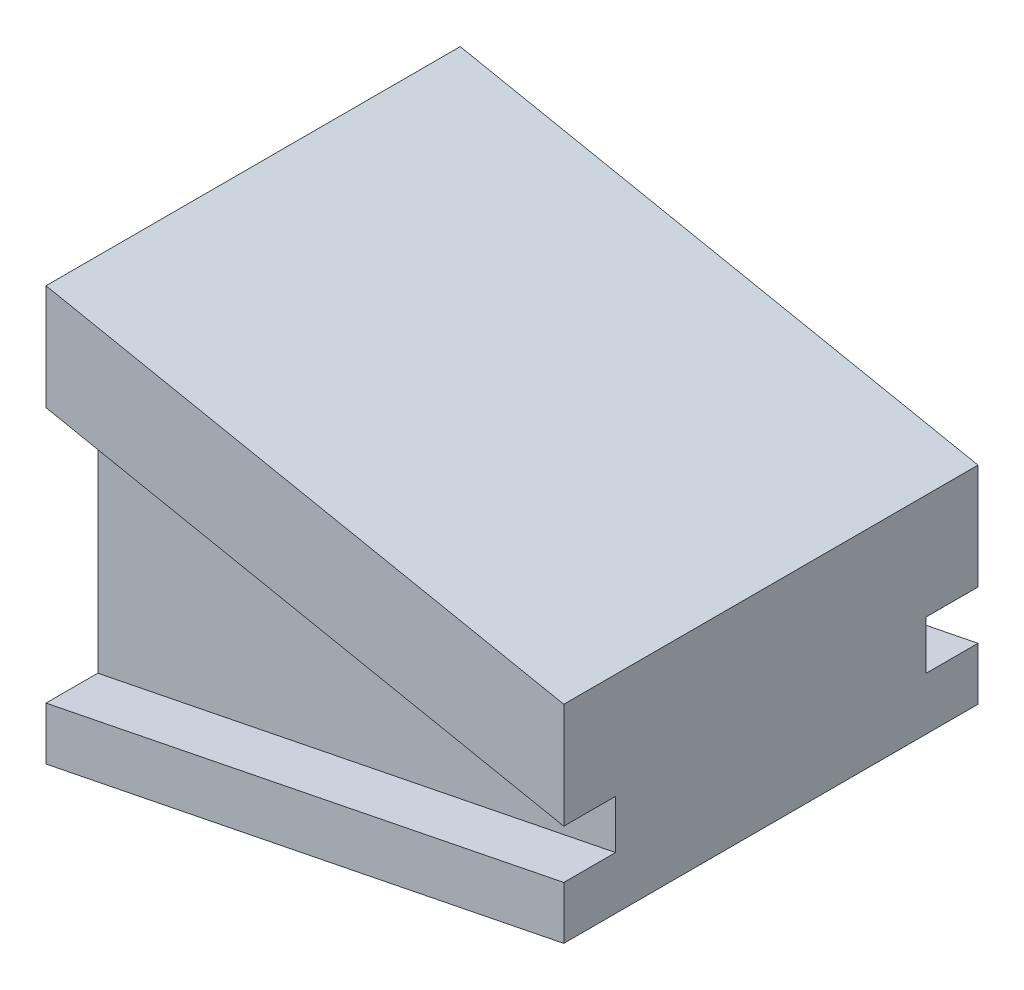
ISO-10303-21;
HEADER;
FILE_DESCRIPTION(('STEP AP214'),'2;1');
FILE_NAME('part.step','',(''),(''),'','','');
FILE_SCHEMA(('AUTOMOTIVE_DESIGN { 1 0 10303 214 1 1 1 1 }'));
ENDSEC;
DATA;
#1=APPLICATION_CONTEXT('core data for automotive mechanical design processes');
#2=APPLICATION_PROTOCOL_DEFINITION('international standard','automotive_design',2000,#1);
#3=PRODUCT_CONTEXT('',#1,'mechanical');
#4=PRODUCT('Part','Part','',(#3));
#5=PRODUCT_RELATED_PRODUCT_CATEGORY('part','',(#4));
#6=PRODUCT_DEFINITION_FORMATION('','',#4);
#7=PRODUCT_DEFINITION_CONTEXT('part definition',#1,'design');
#8=PRODUCT_DEFINITION('design','',#6,#7);
#9=PRODUCT_DEFINITION_SHAPE('','',#8);
#10=(LENGTH_UNIT() NAMED_UNIT(*) SI_UNIT(.MILLI.,.METRE.));
#11=(NAMED_UNIT(*) PLANE_ANGLE_UNIT() SI_UNIT($,.RADIAN.));
#12=(NAMED_UNIT(*) SI_UNIT($,.STERADIAN.) SOLID_ANGLE_UNIT());
#13=UNCERTAINTY_MEASURE_WITH_UNIT(LENGTH_MEASURE(1.E-05),#10,'distance_accuracy_value','');
#14=(GEOMETRIC_REPRESENTATION_CONTEXT(3) GLOBAL_UNCERTAINTY_ASSIGNED_CONTEXT((#13)) GLOBAL_UNIT_ASSIGNED_CONTEXT((#10,
#11,#12)) REPRESENTATION_CONTEXT('',''));
#15=CARTESIAN_POINT('',(0.,0.,0.));
#16=DIRECTION('',(0.,0.,1.));
#17=DIRECTION('',(1.,0.,0.));
#18=AXIS2_PLACEMENT_3D('',#15,#16,#17);
#19=CARTESIAN_POINT('',(0.,0.,0.));
#20=DIRECTION('',(0.,0.,-1.));
#21=DIRECTION('',(-1.,0.,0.));
#22=AXIS2_PLACEMENT_3D('',#19,#20,#21);
#23=PLANE('',#22);
#24=DIRECTION('',(-0.98058067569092,-0.196116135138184,0.));
#25=VECTOR('',#24,1.);
#26=CARTESIAN_POINT('',(-0.980580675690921,4.9029033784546,0.));
#27=LINE('',#26,#25);
#28=CARTESIAN_POINT('',(0.,5.09901951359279,0.));
#29=VERTEX_POINT('',#28);
#30=CARTESIAN_POINT('',(-50.,-4.90098048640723,0.));
#31=VERTEX_POINT('',#30);
#32=EDGE_CURVE('E11',#29,#31,#27,.T.);
#33=ORIENTED_EDGE('',*,*,#32,.F.);
#34=DIRECTION('',(0.,1.,0.));
#35=VECTOR('',#34,1.);
#36=CARTESIAN_POINT('',(0.,0.,0.));
#37=LINE('',#36,#35);
#38=CARTESIAN_POINT('',(0.,0.,0.));
#39=VERTEX_POINT('',#38);
#40=EDGE_CURVE('E166',#39,#29,#37,.T.);
#41=ORIENTED_EDGE('',*,*,#40,.F.);
#42=DIRECTION('',(0.98058067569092,0.196116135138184,0.));
#43=VECTOR('',#42,1.);
#44=CARTESIAN_POINT('',(0.,0.,0.));
#45=LINE('',#44,#43);
#46=CARTESIAN_POINT('',(-50.,-10.,0.));
#47=VERTEX_POINT('',#46);
#48=EDGE_CURVE('E202',#47,#39,#45,.T.);
#49=ORIENTED_EDGE('',*,*,#48,.F.);
#50=DIRECTION('',(0.,-1.,0.));
#51=VECTOR('',#50,1.);
#52=CARTESIAN_POINT('',(-50.,-10.,0.));
#53=LINE('',#52,#51);
#54=EDGE_CURVE('E231',#31,#47,#53,.T.);
#55=ORIENTED_EDGE('',*,*,#54,.F.);
#56=EDGE_LOOP('',(#33,#41,#49,#55));
#57=FACE_BOUND('',#56,.T.);
#58=ADVANCED_FACE('F51',(#57),#23,.T.);
#59=CARTESIAN_POINT('',(0.,0.,40.));
#60=DIRECTION('',(-1.,0.,0.));
#61=DIRECTION('',(0.,-1.,0.));
#62=AXIS2_PLACEMENT_3D('',#59,#60,#61);
#63=PLANE('',#62);
#64=ORIENTED_EDGE('',*,*,#40,.T.);
#65=DIRECTION('',(0.,0.,1.));
#66=VECTOR('',#65,1.);
#67=CARTESIAN_POINT('',(0.,5.09901951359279,-1.2E-05));
#68=LINE('',#67,#66);
#69=CARTESIAN_POINT('',(0.,5.09901951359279,5.));
#70=VERTEX_POINT('',#69);
#71=EDGE_CURVE('E144',#29,#70,#68,.T.);
#72=ORIENTED_EDGE('',*,*,#71,.T.);
#73=DIRECTION('',(0.,1.,0.));
#74=VECTOR('',#73,1.);
#75=CARTESIAN_POINT('',(0.,5.09901951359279,5.));
#76=LINE('',#75,#74);
#77=CARTESIAN_POINT('',(0.,9.80196097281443,5.));
#78=VERTEX_POINT('',#77);
#79=EDGE_CURVE('E153',#70,#78,#76,.T.);
#80=ORIENTED_EDGE('',*,*,#79,.T.);
#81=DIRECTION('',(0.,0.,1.));
#82=VECTOR('',#81,1.);
#83=CARTESIAN_POINT('',(0.,9.80196097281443,-1.2E-05));
#84=LINE('',#83,#82);
#85=CARTESIAN_POINT('',(0.,9.80196097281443,0.));
#86=VERTEX_POINT('',#85);
#87=EDGE_CURVE('E257',#86,#78,#84,.T.);
#88=ORIENTED_EDGE('',*,*,#87,.F.);
#89=CARTESIAN_POINT('',(0.,20.,0.));
#90=VERTEX_POINT('',#89);
#91=EDGE_CURVE('E225',#86,#90,#37,.T.);
#92=ORIENTED_EDGE('',*,*,#91,.T.);
#93=DIRECTION('',(0.,0.,-1.));
#94=VECTOR('',#93,1.);
#95=CARTESIAN_POINT('',(0.,20.,40.));
#96=LINE('',#95,#94);
#97=CARTESIAN_POINT('',(0.,20.,40.));
#98=VERTEX_POINT('',#97);
#99=EDGE_CURVE('E242',#98,#90,#96,.T.);
#100=ORIENTED_EDGE('',*,*,#99,.F.);
#101=DIRECTION('',(0.,1.,0.));
#102=VECTOR('',#101,1.);
#103=CARTESIAN_POINT('',(0.,0.,40.));
#104=LINE('',#103,#102);
#105=CARTESIAN_POINT('',(0.,9.80196097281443,40.));
#106=VERTEX_POINT('',#105);
#107=EDGE_CURVE('E207',#106,#98,#104,.T.);
#108=ORIENTED_EDGE('',*,*,#107,.F.);
#109=DIRECTION('',(0.,0.,-1.));
#110=VECTOR('',#109,1.);
#111=CARTESIAN_POINT('',(0.,9.80196097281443,40.000012));
#112=LINE('',#111,#110);
#113=CARTESIAN_POINT('',(0.,9.80196097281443,35.));
#114=VERTEX_POINT('',#113);
#115=EDGE_CURVE('E198',#106,#114,#112,.T.);
#116=ORIENTED_EDGE('',*,*,#115,.T.);
#117=DIRECTION('',(0.,1.,0.));
#118=VECTOR('',#117,1.);
#119=CARTESIAN_POINT('',(0.,5.09901951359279,35.));
#120=LINE('',#119,#118);
#121=CARTESIAN_POINT('',(0.,5.09901951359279,35.));
#122=VERTEX_POINT('',#121);
#123=EDGE_CURVE('E168',#122,#114,#120,.T.);
#124=ORIENTED_EDGE('',*,*,#123,.F.);
#125=DIRECTION('',(0.,0.,-1.));
#126=VECTOR('',#125,1.);
#127=CARTESIAN_POINT('',(0.,5.09901951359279,40.000012));
#128=LINE('',#127,#126);
#129=CARTESIAN_POINT('',(0.,5.09901951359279,40.));
#130=VERTEX_POINT('',#129);
#131=EDGE_CURVE('E190',#130,#122,#128,.T.);
#132=ORIENTED_EDGE('',*,*,#131,.F.);
#133=CARTESIAN_POINT('',(0.,0.,40.));
#134=VERTEX_POINT('',#133);
#135=EDGE_CURVE('E209',#134,#130,#104,.T.);
#136=ORIENTED_EDGE('',*,*,#135,.F.);
#137=DIRECTION('',(0.,0.,-1.));
#138=VECTOR('',#137,1.);
#139=CARTESIAN_POINT('',(0.,0.,40.));
#140=LINE('',#139,#138);
#141=EDGE_CURVE('E245',#134,#39,#140,.T.);
#142=ORIENTED_EDGE('',*,*,#141,.T.);
#143=EDGE_LOOP('',(#64,#72,#80,#88,#92,#100,#108,#116,#124,#132,#136,#142));
#144=FACE_BOUND('',#143,.T.);
#145=ADVANCED_FACE('F164',(#144),#63,.F.);
#146=CARTESIAN_POINT('',(-50.,-10.,40.));
#147=DIRECTION('',(1.,0.,0.));
#148=DIRECTION('',(0.,1.,0.));
#149=AXIS2_PLACEMENT_3D('',#146,#147,#148);
#150=PLANE('',#149);
#151=DIRECTION('',(0.,-1.,0.));
#152=VECTOR('',#151,1.);
#153=CARTESIAN_POINT('',(-50.,19.8019609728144,5.));
#154=LINE('',#153,#152);
#155=CARTESIAN_POINT('',(-50.,19.8019609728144,5.));
#156=VERTEX_POINT('',#155);
#157=CARTESIAN_POINT('',(-50.,-4.90098048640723,5.));
#158=VERTEX_POINT('',#157);
#159=EDGE_CURVE('E152',#156,#158,#154,.T.);
#160=ORIENTED_EDGE('',*,*,#159,.T.);
#161=DIRECTION('',(0.,0.,1.));
#162=VECTOR('',#161,1.);
#163=CARTESIAN_POINT('',(-50.,-4.90098048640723,-1.2E-05));
#164=LINE('',#163,#162);
#165=EDGE_CURVE('E147',#31,#158,#164,.T.);
#166=ORIENTED_EDGE('',*,*,#165,.F.);
#167=ORIENTED_EDGE('',*,*,#54,.T.);
#168=DIRECTION('',(0.,0.,-1.));
#169=VECTOR('',#168,1.);
#170=CARTESIAN_POINT('',(-50.,-10.,40.));
#171=LINE('',#170,#169);
#172=CARTESIAN_POINT('',(-50.,-10.,40.));
#173=VERTEX_POINT('',#172);
#174=EDGE_CURVE('E221',#173,#47,#171,.T.);
#175=ORIENTED_EDGE('',*,*,#174,.F.);
#176=DIRECTION('',(0.,-1.,0.));
#177=VECTOR('',#176,1.);
#178=CARTESIAN_POINT('',(-50.,-10.,40.));
#179=LINE('',#178,#177);
#180=CARTESIAN_POINT('',(-50.,-4.90098048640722,40.));
#181=VERTEX_POINT('',#180);
#182=EDGE_CURVE('E216',#181,#173,#179,.T.);
#183=ORIENTED_EDGE('',*,*,#182,.F.);
#184=DIRECTION('',(0.,0.,-1.));
#185=VECTOR('',#184,1.);
#186=CARTESIAN_POINT('',(-50.,-4.90098048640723,40.000012));
#187=LINE('',#186,#185);
#188=CARTESIAN_POINT('',(-50.,-4.90098048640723,35.));
#189=VERTEX_POINT('',#188);
#190=EDGE_CURVE('E75',#181,#189,#187,.T.);
#191=ORIENTED_EDGE('',*,*,#190,.T.);
#192=DIRECTION('',(0.,-1.,0.));
#193=VECTOR('',#192,1.);
#194=CARTESIAN_POINT('',(-50.,19.8019609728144,35.));
#195=LINE('',#194,#193);
#196=CARTESIAN_POINT('',(-50.,19.8019609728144,35.));
#197=VERTEX_POINT('',#196);
#198=EDGE_CURVE('E184',#197,#189,#195,.T.);
#199=ORIENTED_EDGE('',*,*,#198,.F.);
#200=DIRECTION('',(0.,0.,-1.));
#201=VECTOR('',#200,1.);
#202=CARTESIAN_POINT('',(-50.,19.8019609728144,40.000012));
#203=LINE('',#202,#201);
#204=CARTESIAN_POINT('',(-50.,19.8019609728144,40.));
#205=VERTEX_POINT('',#204);
#206=EDGE_CURVE('E195',#205,#197,#203,.T.);
#207=ORIENTED_EDGE('',*,*,#206,.F.);
#208=CARTESIAN_POINT('',(-50.,30.,40.));
#209=VERTEX_POINT('',#208);
#210=EDGE_CURVE('E217',#209,#205,#179,.T.);
#211=ORIENTED_EDGE('',*,*,#210,.F.);
#212=DIRECTION('',(0.,0.,-1.));
#213=VECTOR('',#212,1.);
#214=CARTESIAN_POINT('',(-50.,30.,40.));
#215=LINE('',#214,#213);
#216=CARTESIAN_POINT('',(-50.,30.,0.));
#217=VERTEX_POINT('',#216);
#218=EDGE_CURVE('E238',#209,#217,#215,.T.);
#219=ORIENTED_EDGE('',*,*,#218,.T.);
#220=CARTESIAN_POINT('',(-50.,19.8019609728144,0.));
#221=VERTEX_POINT('',#220);
#222=EDGE_CURVE('E208',#217,#221,#53,.T.);
#223=ORIENTED_EDGE('',*,*,#222,.T.);
#224=DIRECTION('',(0.,0.,1.));
#225=VECTOR('',#224,1.);
#226=CARTESIAN_POINT('',(-50.,19.8019609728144,-1.2E-05));
#227=LINE('',#226,#225);
#228=EDGE_CURVE('E67',#221,#156,#227,.T.);
#229=ORIENTED_EDGE('',*,*,#228,.T.);
#230=EDGE_LOOP('',(#160,#166,#167,#175,#183,#191,#199,#207,#211,#219,#223,#229));
#231=FACE_BOUND('',#230,.T.);
#232=ADVANCED_FACE('F319',(#231),#150,.F.);
#233=CARTESIAN_POINT('',(0.,0.,40.));
#234=DIRECTION('',(0.,0.,-1.));
#235=DIRECTION('',(-1.,0.,0.));
#236=AXIS2_PLACEMENT_3D('',#233,#234,#235);
#237=PLANE('',#236);
#238=DIRECTION('',(-0.98058067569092,0.196116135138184,0.));
#239=VECTOR('',#238,1.);
#240=CARTESIAN_POINT('',(1.884992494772,9.42496247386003,40.));
#241=LINE('',#240,#239);
#242=EDGE_CURVE('E251',#106,#205,#241,.T.);
#243=ORIENTED_EDGE('',*,*,#242,.F.);
#244=ORIENTED_EDGE('',*,*,#107,.T.);
#245=DIRECTION('',(-0.98058067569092,0.196116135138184,0.));
#246=VECTOR('',#245,1.);
#247=CARTESIAN_POINT('',(-50.,30.,40.));
#248=LINE('',#247,#246);
#249=EDGE_CURVE('E213',#98,#209,#248,.T.);
#250=ORIENTED_EDGE('',*,*,#249,.T.);
#251=ORIENTED_EDGE('',*,*,#210,.T.);
#252=EDGE_LOOP('',(#243,#244,#250,#251));
#253=FACE_BOUND('',#252,.T.);
#254=ADVANCED_FACE('F311',(#253),#237,.F.);
#255=DIRECTION('',(0.98058067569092,0.196116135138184,0.));
#256=VECTOR('',#255,1.);
#257=CARTESIAN_POINT('',(-0.980580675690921,4.9029033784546,40.));
#258=LINE('',#257,#256);
#259=EDGE_CURVE('E248',#181,#130,#258,.T.);
#260=ORIENTED_EDGE('',*,*,#259,.F.);
#261=ORIENTED_EDGE('',*,*,#182,.T.);
#262=DIRECTION('',(0.98058067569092,0.196116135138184,0.));
#263=VECTOR('',#262,1.);
#264=CARTESIAN_POINT('',(0.,0.,40.));
#265=LINE('',#264,#263);
#266=EDGE_CURVE('E203',#173,#134,#265,.T.);
#267=ORIENTED_EDGE('',*,*,#266,.T.);
#268=ORIENTED_EDGE('',*,*,#135,.T.);
#269=EDGE_LOOP('',(#260,#261,#267,#268));
#270=FACE_BOUND('',#269,.T.);
#271=ADVANCED_FACE('F328',(#270),#237,.F.);
#272=CARTESIAN_POINT('',(0.,0.,40.));
#273=DIRECTION('',(-0.196116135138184,0.98058067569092,0.));
#274=DIRECTION('',(-0.98058067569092,-0.196116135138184,0.));
#275=AXIS2_PLACEMENT_3D('',#272,#273,#274);
#276=PLANE('',#275);
#277=ORIENTED_EDGE('',*,*,#48,.T.);
#278=ORIENTED_EDGE('',*,*,#141,.F.);
#279=ORIENTED_EDGE('',*,*,#266,.F.);
#280=ORIENTED_EDGE('',*,*,#174,.T.);
#281=EDGE_LOOP('',(#277,#278,#279,#280));
#282=FACE_BOUND('',#281,.T.);
#283=ADVANCED_FACE('F53',(#282),#276,.F.);
#284=CARTESIAN_POINT('',(-50.,30.,40.));
#285=DIRECTION('',(-0.196116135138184,-0.98058067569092,0.));
#286=DIRECTION('',(0.98058067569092,-0.196116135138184,0.));
#287=AXIS2_PLACEMENT_3D('',#284,#285,#286);
#288=PLANE('',#287);
#289=DIRECTION('',(-0.98058067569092,0.196116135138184,0.));
#290=VECTOR('',#289,1.);
#291=CARTESIAN_POINT('',(-50.,30.,0.));
#292=LINE('',#291,#290);
#293=EDGE_CURVE('E228',#90,#217,#292,.T.);
#294=ORIENTED_EDGE('',*,*,#293,.T.);
#295=ORIENTED_EDGE('',*,*,#218,.F.);
#296=ORIENTED_EDGE('',*,*,#249,.F.);
#297=ORIENTED_EDGE('',*,*,#99,.T.);
#298=EDGE_LOOP('',(#294,#295,#296,#297));
#299=FACE_BOUND('',#298,.T.);
#300=ADVANCED_FACE('F315',(#299),#288,.F.);
#301=DIRECTION('',(0.98058067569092,-0.196116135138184,0.));
#302=VECTOR('',#301,1.);
#303=CARTESIAN_POINT('',(1.884992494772,9.42496247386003,0.));
#304=LINE('',#303,#302);
#305=EDGE_CURVE('E60',#221,#86,#304,.T.);
#306=ORIENTED_EDGE('',*,*,#305,.F.);
#307=ORIENTED_EDGE('',*,*,#222,.F.);
#308=ORIENTED_EDGE('',*,*,#293,.F.);
#309=ORIENTED_EDGE('',*,*,#91,.F.);
#310=EDGE_LOOP('',(#306,#307,#308,#309));
#311=FACE_BOUND('',#310,.T.);
#312=ADVANCED_FACE('F264',(#311),#23,.T.);
#313=CARTESIAN_POINT('',(0.,9.80196097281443,40.000012));
#314=DIRECTION('',(-0.196116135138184,-0.98058067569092,0.));
#315=DIRECTION('',(0.98058067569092,-0.196116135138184,0.));
#316=AXIS2_PLACEMENT_3D('',#313,#314,#315);
#317=PLANE('',#316);
#318=ORIENTED_EDGE('',*,*,#242,.T.);
#319=ORIENTED_EDGE('',*,*,#206,.T.);
#320=DIRECTION('',(-0.98058067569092,0.196116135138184,0.));
#321=VECTOR('',#320,1.);
#322=CARTESIAN_POINT('',(0.,9.80196097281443,35.));
#323=LINE('',#322,#321);
#324=EDGE_CURVE('E175',#114,#197,#323,.T.);
#325=ORIENTED_EDGE('',*,*,#324,.F.);
#326=ORIENTED_EDGE('',*,*,#115,.F.);
#327=EDGE_LOOP('',(#318,#319,#325,#326));
#328=FACE_BOUND('',#327,.T.);
#329=ADVANCED_FACE('F322',(#328),#317,.T.);
#330=CARTESIAN_POINT('',(-50.,-4.90098048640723,40.000012));
#331=DIRECTION('',(-0.196116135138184,0.98058067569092,0.));
#332=DIRECTION('',(-0.98058067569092,-0.196116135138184,0.));
#333=AXIS2_PLACEMENT_3D('',#330,#331,#332);
#334=PLANE('',#333);
#335=ORIENTED_EDGE('',*,*,#259,.T.);
#336=ORIENTED_EDGE('',*,*,#131,.T.);
#337=DIRECTION('',(0.98058067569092,0.196116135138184,0.));
#338=VECTOR('',#337,1.);
#339=CARTESIAN_POINT('',(-50.,-4.90098048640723,35.));
#340=LINE('',#339,#338);
#341=EDGE_CURVE('E186',#189,#122,#340,.T.);
#342=ORIENTED_EDGE('',*,*,#341,.F.);
#343=ORIENTED_EDGE('',*,*,#190,.F.);
#344=EDGE_LOOP('',(#335,#336,#342,#343));
#345=FACE_BOUND('',#344,.T.);
#346=ADVANCED_FACE('F347',(#345),#334,.T.);
#347=CARTESIAN_POINT('',(0.,0.,35.));
#348=DIRECTION('',(0.,0.,1.));
#349=DIRECTION('',(1.,0.,0.));
#350=AXIS2_PLACEMENT_3D('',#347,#348,#349);
#351=PLANE('',#350);
#352=ORIENTED_EDGE('',*,*,#123,.T.);
#353=ORIENTED_EDGE('',*,*,#324,.T.);
#354=ORIENTED_EDGE('',*,*,#198,.T.);
#355=ORIENTED_EDGE('',*,*,#341,.T.);
#356=EDGE_LOOP('',(#352,#353,#354,#355));
#357=FACE_BOUND('',#356,.T.);
#358=ADVANCED_FACE('F324',(#357),#351,.T.);
#359=CARTESIAN_POINT('',(-50.,-4.90098048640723,-1.2E-05));
#360=DIRECTION('',(0.196116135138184,-0.98058067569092,0.));
#361=DIRECTION('',(0.98058067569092,0.196116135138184,0.));
#362=AXIS2_PLACEMENT_3D('',#359,#360,#361);
#363=PLANE('',#362);
#364=ORIENTED_EDGE('',*,*,#32,.T.);
#365=ORIENTED_EDGE('',*,*,#165,.T.);
#366=DIRECTION('',(0.98058067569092,0.196116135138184,0.));
#367=VECTOR('',#366,1.);
#368=CARTESIAN_POINT('',(-50.,-4.90098048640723,5.));
#369=LINE('',#368,#367);
#370=EDGE_CURVE('E140',#158,#70,#369,.T.);
#371=ORIENTED_EDGE('',*,*,#370,.T.);
#372=ORIENTED_EDGE('',*,*,#71,.F.);
#373=EDGE_LOOP('',(#364,#365,#371,#372));
#374=FACE_BOUND('',#373,.T.);
#375=ADVANCED_FACE('F142',(#374),#363,.F.);
#376=CARTESIAN_POINT('',(0.,9.80196097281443,-1.2E-05));
#377=DIRECTION('',(0.196116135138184,0.98058067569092,0.));
#378=DIRECTION('',(-0.98058067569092,0.196116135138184,0.));
#379=AXIS2_PLACEMENT_3D('',#376,#377,#378);
#380=PLANE('',#379);
#381=ORIENTED_EDGE('',*,*,#305,.T.);
#382=ORIENTED_EDGE('',*,*,#87,.T.);
#383=DIRECTION('',(-0.98058067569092,0.196116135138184,0.));
#384=VECTOR('',#383,1.);
#385=CARTESIAN_POINT('',(0.,9.80196097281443,5.));
#386=LINE('',#385,#384);
#387=EDGE_CURVE('E158',#78,#156,#386,.T.);
#388=ORIENTED_EDGE('',*,*,#387,.T.);
#389=ORIENTED_EDGE('',*,*,#228,.F.);
#390=EDGE_LOOP('',(#381,#382,#388,#389));
#391=FACE_BOUND('',#390,.T.);
#392=ADVANCED_FACE('F256',(#391),#380,.F.);
#393=CARTESIAN_POINT('',(0.,0.,5.00000000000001));
#394=DIRECTION('',(0.,0.,-1.));
#395=DIRECTION('',(1.,0.,0.));
#396=AXIS2_PLACEMENT_3D('',#393,#394,#395);
#397=PLANE('',#396);
#398=ORIENTED_EDGE('',*,*,#79,.F.);
#399=ORIENTED_EDGE('',*,*,#370,.F.);
#400=ORIENTED_EDGE('',*,*,#159,.F.);
#401=ORIENTED_EDGE('',*,*,#387,.F.);
#402=EDGE_LOOP('',(#398,#399,#400,#401));
#403=FACE_BOUND('',#402,.T.);
#404=ADVANCED_FACE('F157',(#403),#397,.T.);
#405=CLOSED_SHELL('',(#58,#145,#232,#254,#271,#283,#300,#312,#329,#346,#358,#375,#392,#404));
#406=MANIFOLD_SOLID_BREP('B2',#405);
#407=ADVANCED_BREP_SHAPE_REPRESENTATION('',(#18,#406),#14);
#408=SHAPE_DEFINITION_REPRESENTATION(#9,#407);
ENDSEC;
END-ISO-10303-21;
